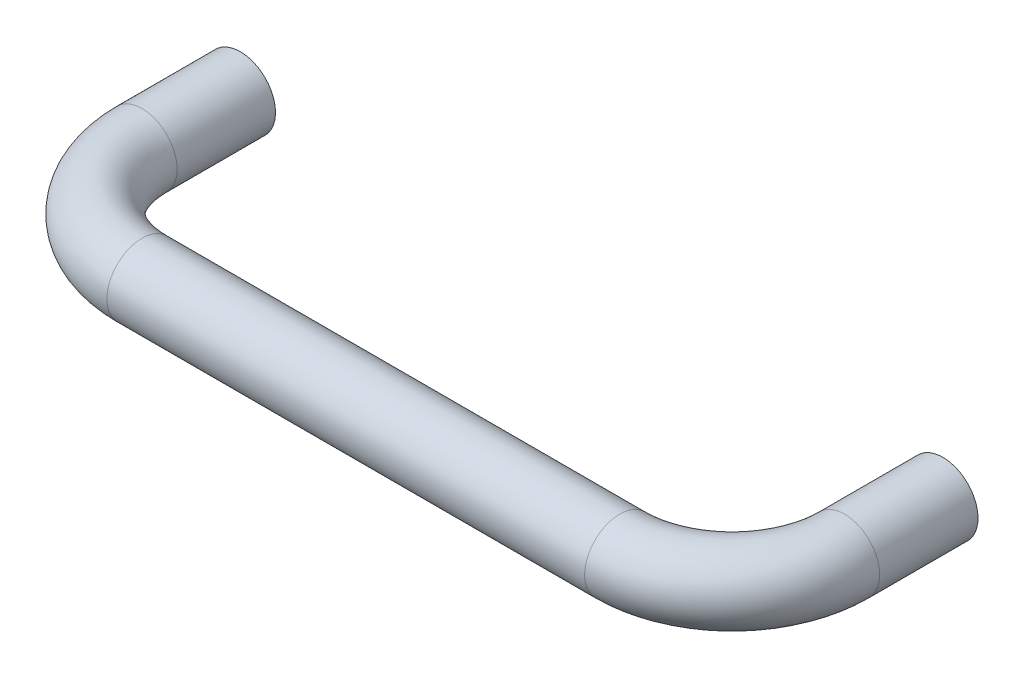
ISO-10303-21;
HEADER;
FILE_DESCRIPTION(('STEP AP214'),'2;1');
FILE_NAME('part.step','',(''),(''),'','','');
FILE_SCHEMA(('AUTOMOTIVE_DESIGN { 1 0 10303 214 1 1 1 1 }'));
ENDSEC;
DATA;
#1=APPLICATION_CONTEXT('core data for automotive mechanical design processes');
#2=APPLICATION_PROTOCOL_DEFINITION('international standard','automotive_design',2000,#1);
#3=PRODUCT_CONTEXT('',#1,'mechanical');
#4=PRODUCT('Part','Part','',(#3));
#5=PRODUCT_RELATED_PRODUCT_CATEGORY('part','',(#4));
#6=PRODUCT_DEFINITION_FORMATION('','',#4);
#7=PRODUCT_DEFINITION_CONTEXT('part definition',#1,'design');
#8=PRODUCT_DEFINITION('design','',#6,#7);
#9=PRODUCT_DEFINITION_SHAPE('','',#8);
#10=(LENGTH_UNIT() NAMED_UNIT(*) SI_UNIT(.MILLI.,.METRE.));
#11=(NAMED_UNIT(*) PLANE_ANGLE_UNIT() SI_UNIT($,.RADIAN.));
#12=(NAMED_UNIT(*) SI_UNIT($,.STERADIAN.) SOLID_ANGLE_UNIT());
#13=UNCERTAINTY_MEASURE_WITH_UNIT(LENGTH_MEASURE(1.E-05),#10,'distance_accuracy_value','');
#14=(GEOMETRIC_REPRESENTATION_CONTEXT(3) GLOBAL_UNCERTAINTY_ASSIGNED_CONTEXT((#13)) GLOBAL_UNIT_ASSIGNED_CONTEXT((#10,
#11,#12)) REPRESENTATION_CONTEXT('',''));
#15=CARTESIAN_POINT('',(0.,0.,0.));
#16=DIRECTION('',(0.,0.,1.));
#17=DIRECTION('',(1.,0.,0.));
#18=AXIS2_PLACEMENT_3D('',#15,#16,#17);
#19=CARTESIAN_POINT('',(199.992502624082,0.,28.));
#20=DIRECTION('',(0.,0.,-1.));
#21=DIRECTION('',(1.,0.,0.));
#22=AXIS2_PLACEMENT_3D('',#19,#20,#21);
#23=CYLINDRICAL_SURFACE('',#22,10.);
#24=CARTESIAN_POINT('',(199.992502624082,0.,28.));
#25=DIRECTION('',(0.,0.,-1.));
#26=DIRECTION('',(0.,-1.,0.));
#27=AXIS2_PLACEMENT_3D('',#24,#25,#26);
#28=CIRCLE('',#27,10.);
#29=CARTESIAN_POINT('',(209.992502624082,0.,28.));
#30=VERTEX_POINT('',#29);
#31=EDGE_CURVE('E18',#30,#30,#28,.T.);
#32=ORIENTED_EDGE('',*,*,#31,.T.);
#33=EDGE_LOOP('',(#32));
#34=FACE_BOUND('',#33,.T.);
#35=CARTESIAN_POINT('',(199.992502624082,0.,0.));
#36=DIRECTION('',(0.,0.,-1.));
#37=DIRECTION('',(0.,-1.,0.));
#38=AXIS2_PLACEMENT_3D('',#35,#36,#37);
#39=CIRCLE('',#38,10.);
#40=CARTESIAN_POINT('',(199.992502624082,-9.99999999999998,0.));
#41=VERTEX_POINT('',#40);
#42=EDGE_CURVE('E8',#41,#41,#39,.T.);
#43=ORIENTED_EDGE('',*,*,#42,.F.);
#44=EDGE_LOOP('',(#43));
#45=FACE_BOUND('',#44,.T.);
#46=ADVANCED_FACE('F12',(#34,#45),#23,.T.);
#47=CARTESIAN_POINT('',(167.992502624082,0.,28.));
#48=DIRECTION('',(0.,1.,0.));
#49=DIRECTION('',(-1.,0.,0.));
#50=AXIS2_PLACEMENT_3D('',#47,#48,#49);
#51=TOROIDAL_SURFACE('',#50,32.,10.);
#52=CARTESIAN_POINT('',(167.992502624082,0.,60.));
#53=DIRECTION('',(1.,0.,0.));
#54=DIRECTION('',(0.,-1.,0.));
#55=AXIS2_PLACEMENT_3D('',#52,#53,#54);
#56=CIRCLE('',#55,10.);
#57=CARTESIAN_POINT('',(167.992502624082,0.,70.));
#58=VERTEX_POINT('',#57);
#59=EDGE_CURVE('E22',#58,#58,#56,.T.);
#60=CARTESIAN_POINT('',(167.992502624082,0.,28.));
#61=DIRECTION('',(0.,1.,0.));
#62=DIRECTION('',(-1.,0.,0.));
#63=AXIS2_PLACEMENT_3D('',#60,#61,#62);
#64=CIRCLE('',#63,42.);
#65=EDGE_CURVE('',#58,#30,#64,.T.);
#66=ORIENTED_EDGE('',*,*,#59,.T.);
#67=ORIENTED_EDGE('',*,*,#31,.F.);
#68=ORIENTED_EDGE('',*,*,#65,.T.);
#69=ORIENTED_EDGE('',*,*,#65,.F.);
#70=EDGE_LOOP('',(#66,#68,#67,#69));
#71=FACE_BOUND('',#70,.T.);
#72=ADVANCED_FACE('F81',(#71),#51,.T.);
#73=CARTESIAN_POINT('',(31.9925026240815,0.,60.));
#74=DIRECTION('',(1.,0.,0.));
#75=DIRECTION('',(0.,0.,1.));
#76=AXIS2_PLACEMENT_3D('',#73,#74,#75);
#77=CYLINDRICAL_SURFACE('',#76,10.);
#78=CARTESIAN_POINT('',(31.9925026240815,0.,60.));
#79=DIRECTION('',(1.,0.,0.));
#80=DIRECTION('',(0.,-1.,0.));
#81=AXIS2_PLACEMENT_3D('',#78,#79,#80);
#82=CIRCLE('',#81,10.);
#83=CARTESIAN_POINT('',(31.9925026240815,0.,70.));
#84=VERTEX_POINT('',#83);
#85=EDGE_CURVE('E26',#84,#84,#82,.T.);
#86=ORIENTED_EDGE('',*,*,#85,.T.);
#87=EDGE_LOOP('',(#86));
#88=FACE_BOUND('',#87,.T.);
#89=ORIENTED_EDGE('',*,*,#59,.F.);
#90=EDGE_LOOP('',(#89));
#91=FACE_BOUND('',#90,.T.);
#92=ADVANCED_FACE('F77',(#88,#91),#77,.T.);
#93=CARTESIAN_POINT('',(31.9925026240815,0.,28.));
#94=DIRECTION('',(0.,1.,0.));
#95=DIRECTION('',(-1.,0.,0.));
#96=AXIS2_PLACEMENT_3D('',#93,#94,#95);
#97=TOROIDAL_SURFACE('',#96,32.,10.);
#98=CARTESIAN_POINT('',(-0.00749737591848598,0.,28.));
#99=DIRECTION('',(0.,0.,1.));
#100=DIRECTION('',(0.,-1.,0.));
#101=AXIS2_PLACEMENT_3D('',#98,#99,#100);
#102=CIRCLE('',#101,10.);
#103=CARTESIAN_POINT('',(-10.0074973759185,0.,28.));
#104=VERTEX_POINT('',#103);
#105=EDGE_CURVE('E31',#104,#104,#102,.T.);
#106=CARTESIAN_POINT('',(31.9925026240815,0.,28.));
#107=DIRECTION('',(0.,1.,0.));
#108=DIRECTION('',(-1.,0.,0.));
#109=AXIS2_PLACEMENT_3D('',#106,#107,#108);
#110=CIRCLE('',#109,42.);
#111=EDGE_CURVE('',#104,#84,#110,.T.);
#112=ORIENTED_EDGE('',*,*,#105,.T.);
#113=ORIENTED_EDGE('',*,*,#85,.F.);
#114=ORIENTED_EDGE('',*,*,#111,.T.);
#115=ORIENTED_EDGE('',*,*,#111,.F.);
#116=EDGE_LOOP('',(#112,#114,#113,#115));
#117=FACE_BOUND('',#116,.T.);
#118=ADVANCED_FACE('F64',(#117),#97,.T.);
#119=CARTESIAN_POINT('',(-0.00749737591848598,0.,28.));
#120=DIRECTION('',(0.,0.,-1.));
#121=DIRECTION('',(0.,1.,0.));
#122=AXIS2_PLACEMENT_3D('',#119,#120,#121);
#123=CYLINDRICAL_SURFACE('',#122,10.);
#124=ORIENTED_EDGE('',*,*,#105,.F.);
#125=EDGE_LOOP('',(#124));
#126=FACE_BOUND('',#125,.T.);
#127=CARTESIAN_POINT('',(-0.00749737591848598,0.,0.));
#128=DIRECTION('',(0.,0.,1.));
#129=DIRECTION('',(0.,-1.,0.));
#130=AXIS2_PLACEMENT_3D('',#127,#128,#129);
#131=CIRCLE('',#130,10.);
#132=CARTESIAN_POINT('',(-0.00749737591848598,-9.99999999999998,0.));
#133=VERTEX_POINT('',#132);
#134=EDGE_CURVE('E34',#133,#133,#131,.T.);
#135=ORIENTED_EDGE('',*,*,#134,.T.);
#136=EDGE_LOOP('',(#135));
#137=FACE_BOUND('',#136,.T.);
#138=ADVANCED_FACE('F62',(#126,#137),#123,.T.);
#139=CARTESIAN_POINT('',(199.992502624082,0.,0.));
#140=DIRECTION('',(0.,0.,-1.));
#141=DIRECTION('',(0.,-1.,0.));
#142=AXIS2_PLACEMENT_3D('',#139,#140,#141);
#143=PLANE('',#142);
#144=CARTESIAN_POINT('',(199.985005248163,0.,0.));
#145=DIRECTION('',(0.,0.,-1.));
#146=DIRECTION('',(0.,-1.,0.));
#147=AXIS2_PLACEMENT_3D('',#144,#145,#146);
#148=CIRCLE('',#147,4.53099737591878);
#149=CARTESIAN_POINT('',(199.985005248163,-4.53099737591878,0.));
#150=VERTEX_POINT('',#149);
#151=EDGE_CURVE('E52',#150,#150,#148,.T.);
#152=ORIENTED_EDGE('',*,*,#151,.F.);
#153=EDGE_LOOP('',(#152));
#154=FACE_BOUND('',#153,.T.);
#155=ORIENTED_EDGE('',*,*,#42,.T.);
#156=EDGE_LOOP('',(#155));
#157=FACE_BOUND('',#156,.T.);
#158=ADVANCED_FACE('F59',(#154,#157),#143,.T.);
#159=CARTESIAN_POINT('',(-0.00749737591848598,0.,0.));
#160=DIRECTION('',(0.,0.,1.));
#161=DIRECTION('',(0.,-1.,0.));
#162=AXIS2_PLACEMENT_3D('',#159,#160,#161);
#163=PLANE('',#162);
#164=CARTESIAN_POINT('',(0.,0.,0.));
#165=DIRECTION('',(0.,0.,1.));
#166=DIRECTION('',(0.,-1.,0.));
#167=AXIS2_PLACEMENT_3D('',#164,#165,#166);
#168=CIRCLE('',#167,4.53099737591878);
#169=CARTESIAN_POINT('',(0.,-4.53099737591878,0.));
#170=VERTEX_POINT('',#169);
#171=EDGE_CURVE('E43',#170,#170,#168,.T.);
#172=ORIENTED_EDGE('',*,*,#171,.T.);
#173=EDGE_LOOP('',(#172));
#174=FACE_BOUND('',#173,.T.);
#175=ORIENTED_EDGE('',*,*,#134,.F.);
#176=EDGE_LOOP('',(#175));
#177=FACE_BOUND('',#176,.T.);
#178=ADVANCED_FACE('F61',(#174,#177),#163,.F.);
#179=CARTESIAN_POINT('',(-4.,0.,15.));
#180=DIRECTION('',(0.,0.,-1.));
#181=DIRECTION('',(0.,1.,0.));
#182=AXIS2_PLACEMENT_3D('',#179,#180,#181);
#183=PLANE('',#182);
#184=CARTESIAN_POINT('',(0.,0.,15.));
#185=DIRECTION('',(0.,0.,1.));
#186=DIRECTION('',(0.,-1.,0.));
#187=AXIS2_PLACEMENT_3D('',#184,#185,#186);
#188=CIRCLE('',#187,4.00000000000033);
#189=CARTESIAN_POINT('',(0.,-4.00000000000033,15.));
#190=VERTEX_POINT('',#189);
#191=EDGE_CURVE('E37',#190,#190,#188,.T.);
#192=ORIENTED_EDGE('',*,*,#191,.F.);
#193=EDGE_LOOP('',(#192));
#194=FACE_BOUND('',#193,.T.);
#195=ADVANCED_FACE('F71',(#194),#183,.T.);
#196=CARTESIAN_POINT('',(0.,0.,28.0149947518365));
#197=DIRECTION('',(0.,0.,1.));
#198=DIRECTION('',(0.,-1.,0.));
#199=AXIS2_PLACEMENT_3D('',#196,#197,#198);
#200=CYLINDRICAL_SURFACE('',#199,4.00000000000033);
#201=ORIENTED_EDGE('',*,*,#191,.T.);
#202=EDGE_LOOP('',(#201));
#203=FACE_BOUND('',#202,.T.);
#204=CARTESIAN_POINT('',(0.,0.,0.530997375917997));
#205=DIRECTION('',(0.,0.,1.));
#206=DIRECTION('',(0.,-1.,0.));
#207=AXIS2_PLACEMENT_3D('',#204,#205,#206);
#208=CIRCLE('',#207,4.00000000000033);
#209=CARTESIAN_POINT('',(0.,-4.00000000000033,0.530997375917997));
#210=VERTEX_POINT('',#209);
#211=EDGE_CURVE('E40',#210,#210,#208,.T.);
#212=ORIENTED_EDGE('',*,*,#211,.F.);
#213=EDGE_LOOP('',(#212));
#214=FACE_BOUND('',#213,.T.);
#215=ADVANCED_FACE('F137',(#203,#214),#200,.F.);
#216=CARTESIAN_POINT('',(0.,0.,0.530997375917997));
#217=DIRECTION('',(0.,0.,-1.));
#218=DIRECTION('',(0.,1.,0.));
#219=AXIS2_PLACEMENT_3D('',#216,#217,#218);
#220=CONICAL_SURFACE('',#219,4.00000000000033,0.7853981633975);
#221=ORIENTED_EDGE('',*,*,#171,.F.);
#222=EDGE_LOOP('',(#221));
#223=FACE_BOUND('',#222,.T.);
#224=ORIENTED_EDGE('',*,*,#211,.T.);
#225=EDGE_LOOP('',(#224));
#226=FACE_BOUND('',#225,.T.);
#227=ADVANCED_FACE('F145',(#223,#226),#220,.F.);
#228=CARTESIAN_POINT('',(203.985005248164,0.,15.));
#229=DIRECTION('',(0.,0.,-1.));
#230=DIRECTION('',(0.,1.,0.));
#231=AXIS2_PLACEMENT_3D('',#228,#229,#230);
#232=PLANE('',#231);
#233=CARTESIAN_POINT('',(199.985005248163,0.,15.));
#234=DIRECTION('',(0.,0.,-1.));
#235=DIRECTION('',(0.,-1.,0.));
#236=AXIS2_PLACEMENT_3D('',#233,#234,#235);
#237=CIRCLE('',#236,4.00000000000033);
#238=CARTESIAN_POINT('',(199.985005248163,-4.00000000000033,15.));
#239=VERTEX_POINT('',#238);
#240=EDGE_CURVE('E46',#239,#239,#237,.T.);
#241=ORIENTED_EDGE('',*,*,#240,.T.);
#242=EDGE_LOOP('',(#241));
#243=FACE_BOUND('',#242,.T.);
#244=ADVANCED_FACE('F154',(#243),#232,.T.);
#245=CARTESIAN_POINT('',(199.985005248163,0.,28.0149947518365));
#246=DIRECTION('',(0.,0.,1.));
#247=DIRECTION('',(0.,-1.,0.));
#248=AXIS2_PLACEMENT_3D('',#245,#246,#247);
#249=CYLINDRICAL_SURFACE('',#248,4.00000000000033);
#250=ORIENTED_EDGE('',*,*,#240,.F.);
#251=EDGE_LOOP('',(#250));
#252=FACE_BOUND('',#251,.T.);
#253=CARTESIAN_POINT('',(199.985005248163,0.,0.530997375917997));
#254=DIRECTION('',(0.,0.,-1.));
#255=DIRECTION('',(0.,-1.,0.));
#256=AXIS2_PLACEMENT_3D('',#253,#254,#255);
#257=CIRCLE('',#256,4.00000000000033);
#258=CARTESIAN_POINT('',(199.985005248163,-4.00000000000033,0.530997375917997));
#259=VERTEX_POINT('',#258);
#260=EDGE_CURVE('E49',#259,#259,#257,.T.);
#261=ORIENTED_EDGE('',*,*,#260,.T.);
#262=EDGE_LOOP('',(#261));
#263=FACE_BOUND('',#262,.T.);
#264=ADVANCED_FACE('F163',(#252,#263),#249,.F.);
#265=CARTESIAN_POINT('',(199.985005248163,0.,0.530997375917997));
#266=DIRECTION('',(0.,0.,-1.));
#267=DIRECTION('',(0.,1.,0.));
#268=AXIS2_PLACEMENT_3D('',#265,#266,#267);
#269=CONICAL_SURFACE('',#268,4.00000000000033,0.7853981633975);
#270=ORIENTED_EDGE('',*,*,#151,.T.);
#271=EDGE_LOOP('',(#270));
#272=FACE_BOUND('',#271,.T.);
#273=ORIENTED_EDGE('',*,*,#260,.F.);
#274=EDGE_LOOP('',(#273));
#275=FACE_BOUND('',#274,.T.);
#276=ADVANCED_FACE('F56',(#272,#275),#269,.F.);
#277=CLOSED_SHELL('',(#46,#72,#92,#118,#138,#158,#178,#195,#215,#227,#244,#264,#276));
#278=MANIFOLD_SOLID_BREP('B1',#277);
#279=ADVANCED_BREP_SHAPE_REPRESENTATION('',(#18,#278),#14);
#280=SHAPE_DEFINITION_REPRESENTATION(#9,#279);
ENDSEC;
END-ISO-10303-21;
